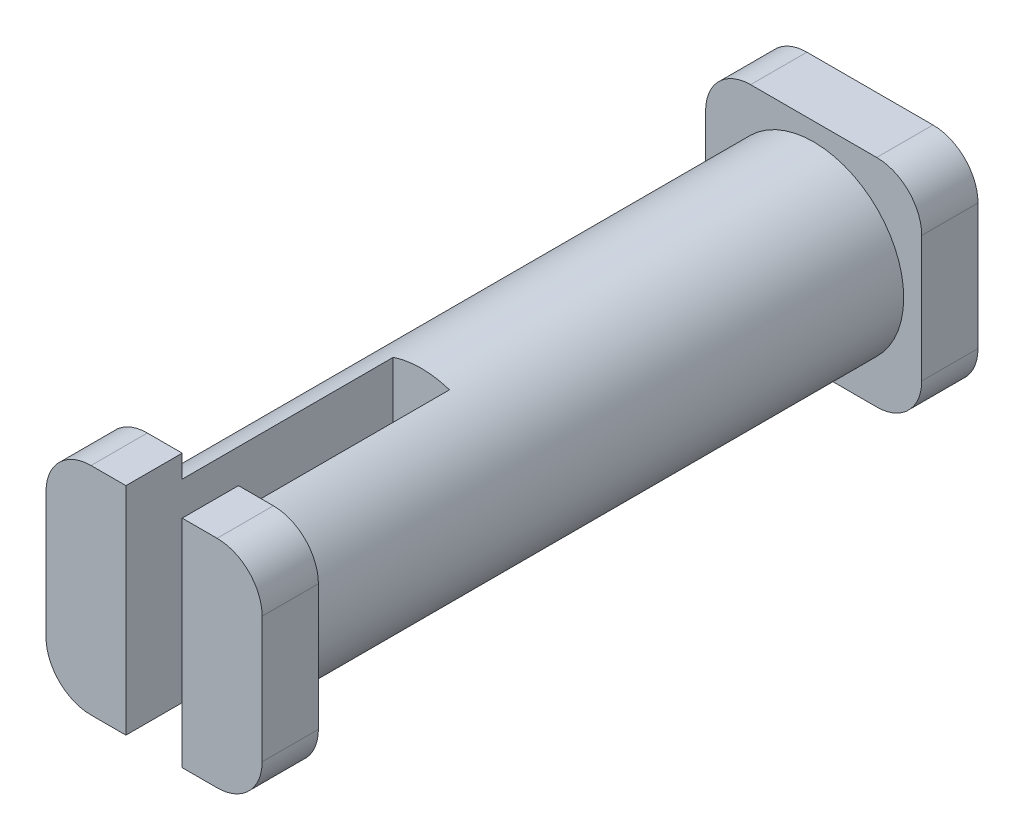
ISO-10303-21;
HEADER;
FILE_DESCRIPTION(('STEP AP214'),'2;1');
FILE_NAME('part.step','',(''),(''),'','','');
FILE_SCHEMA(('AUTOMOTIVE_DESIGN { 1 0 10303 214 1 1 1 1 }'));
ENDSEC;
DATA;
#1=APPLICATION_CONTEXT('core data for automotive mechanical design processes');
#2=APPLICATION_PROTOCOL_DEFINITION('international standard','automotive_design',2000,#1);
#3=PRODUCT_CONTEXT('',#1,'mechanical');
#4=PRODUCT('Part','Part','',(#3));
#5=PRODUCT_RELATED_PRODUCT_CATEGORY('part','',(#4));
#6=PRODUCT_DEFINITION_FORMATION('','',#4);
#7=PRODUCT_DEFINITION_CONTEXT('part definition',#1,'design');
#8=PRODUCT_DEFINITION('design','',#6,#7);
#9=PRODUCT_DEFINITION_SHAPE('','',#8);
#10=(LENGTH_UNIT() NAMED_UNIT(*) SI_UNIT(.MILLI.,.METRE.));
#11=(NAMED_UNIT(*) PLANE_ANGLE_UNIT() SI_UNIT($,.RADIAN.));
#12=(NAMED_UNIT(*) SI_UNIT($,.STERADIAN.) SOLID_ANGLE_UNIT());
#13=UNCERTAINTY_MEASURE_WITH_UNIT(LENGTH_MEASURE(1.E-05),#10,'distance_accuracy_value','');
#14=(GEOMETRIC_REPRESENTATION_CONTEXT(3) GLOBAL_UNCERTAINTY_ASSIGNED_CONTEXT((#13)) GLOBAL_UNIT_ASSIGNED_CONTEXT((#10,
#11,#12)) REPRESENTATION_CONTEXT('',''));
#15=CARTESIAN_POINT('',(0.,0.,0.));
#16=DIRECTION('',(0.,0.,1.));
#17=DIRECTION('',(1.,0.,0.));
#18=AXIS2_PLACEMENT_3D('',#15,#16,#17);
#19=CARTESIAN_POINT('',(1.27000000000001,0.,18.6055));
#20=DIRECTION('',(0.,-1.,0.));
#21=DIRECTION('',(0.,0.,-1.));
#22=AXIS2_PLACEMENT_3D('',#19,#20,#21);
#23=PLANE('',#22);
#24=DIRECTION('',(0.,0.,1.));
#25=VECTOR('',#24,1.);
#26=CARTESIAN_POINT('',(2.25425,0.,12.652375));
#27=LINE('',#26,#25);
#28=CARTESIAN_POINT('',(2.25425,0.,18.6055));
#29=VERTEX_POINT('',#28);
#30=CARTESIAN_POINT('',(2.25425,0.,20.193));
#31=VERTEX_POINT('',#30);
#32=EDGE_CURVE('E259',#29,#31,#27,.T.);
#33=ORIENTED_EDGE('',*,*,#32,.T.);
#34=DIRECTION('',(1.,0.,0.));
#35=VECTOR('',#34,1.);
#36=CARTESIAN_POINT('',(1.27000000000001,0.,20.193));
#37=LINE('',#36,#35);
#38=CARTESIAN_POINT('',(1.27000000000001,0.,20.193));
#39=VERTEX_POINT('',#38);
#40=EDGE_CURVE('E304',#39,#31,#37,.T.);
#41=ORIENTED_EDGE('',*,*,#40,.F.);
#42=DIRECTION('',(0.,0.,1.));
#43=VECTOR('',#42,1.);
#44=CARTESIAN_POINT('',(1.27000000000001,0.,18.6055));
#45=LINE('',#44,#43);
#46=CARTESIAN_POINT('',(1.27000000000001,0.,18.6055));
#47=VERTEX_POINT('',#46);
#48=EDGE_CURVE('E342',#47,#39,#45,.T.);
#49=ORIENTED_EDGE('',*,*,#48,.F.);
#50=DIRECTION('',(1.,0.,0.));
#51=VECTOR('',#50,1.);
#52=CARTESIAN_POINT('',(1.27000000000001,0.,18.6055));
#53=LINE('',#52,#51);
#54=EDGE_CURVE('E273',#47,#29,#53,.T.);
#55=ORIENTED_EDGE('',*,*,#54,.T.);
#56=EDGE_LOOP('',(#33,#41,#49,#55));
#57=FACE_BOUND('',#56,.T.);
#58=ADVANCED_FACE('F36',(#57),#23,.T.);
#59=CARTESIAN_POINT('',(1.27,6.096,18.6055));
#60=DIRECTION('',(0.,1.,0.));
#61=DIRECTION('',(0.,0.,1.));
#62=AXIS2_PLACEMENT_3D('',#59,#60,#61);
#63=PLANE('',#62);
#64=DIRECTION('',(0.,0.,1.));
#65=VECTOR('',#64,1.);
#66=CARTESIAN_POINT('',(2.25425,6.096,12.652375));
#67=LINE('',#66,#65);
#68=CARTESIAN_POINT('',(2.25425,6.096,18.6055));
#69=VERTEX_POINT('',#68);
#70=CARTESIAN_POINT('',(2.25425,6.096,20.193));
#71=VERTEX_POINT('',#70);
#72=EDGE_CURVE('E468',#69,#71,#67,.T.);
#73=ORIENTED_EDGE('',*,*,#72,.F.);
#74=DIRECTION('',(-1.,0.,0.));
#75=VECTOR('',#74,1.);
#76=CARTESIAN_POINT('',(1.27,6.096,18.6055));
#77=LINE('',#76,#75);
#78=CARTESIAN_POINT('',(1.27,6.096,18.6055));
#79=VERTEX_POINT('',#78);
#80=EDGE_CURVE('E289',#69,#79,#77,.T.);
#81=ORIENTED_EDGE('',*,*,#80,.T.);
#82=DIRECTION('',(0.,0.,1.));
#83=VECTOR('',#82,1.);
#84=CARTESIAN_POINT('',(1.27,6.096,18.6055));
#85=LINE('',#84,#83);
#86=CARTESIAN_POINT('',(1.27,6.096,20.193));
#87=VERTEX_POINT('',#86);
#88=EDGE_CURVE('E333',#79,#87,#85,.T.);
#89=ORIENTED_EDGE('',*,*,#88,.T.);
#90=DIRECTION('',(-1.,0.,0.));
#91=VECTOR('',#90,1.);
#92=CARTESIAN_POINT('',(1.27,6.096,20.193));
#93=LINE('',#92,#91);
#94=EDGE_CURVE('E316',#71,#87,#93,.T.);
#95=ORIENTED_EDGE('',*,*,#94,.F.);
#96=EDGE_LOOP('',(#73,#81,#89,#95));
#97=FACE_BOUND('',#96,.T.);
#98=ADVANCED_FACE('F219',(#97),#63,.T.);
#99=CARTESIAN_POINT('',(4.826,1.27,18.6055));
#100=DIRECTION('',(0.,0.,-1.));
#101=DIRECTION('',(1.,0.,0.));
#102=AXIS2_PLACEMENT_3D('',#99,#100,#101);
#103=PLANE('',#102);
#104=DIRECTION('',(0.,1.,0.));
#105=VECTOR('',#104,1.);
#106=CARTESIAN_POINT('',(2.25425,1.27,18.6055));
#107=LINE('',#106,#105);
#108=CARTESIAN_POINT('',(2.25425,0.635208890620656,18.6055));
#109=VERTEX_POINT('',#108);
#110=EDGE_CURVE('E356',#29,#109,#107,.T.);
#111=ORIENTED_EDGE('',*,*,#110,.F.);
#112=ORIENTED_EDGE('',*,*,#54,.F.);
#113=CARTESIAN_POINT('',(1.27,1.27,18.6055));
#114=DIRECTION('',(0.,0.,1.));
#115=DIRECTION('',(-1.,0.,0.));
#116=AXIS2_PLACEMENT_3D('',#113,#114,#115);
#117=CIRCLE('',#116,1.27);
#118=CARTESIAN_POINT('',(0.,1.27,18.6055));
#119=VERTEX_POINT('',#118);
#120=EDGE_CURVE('E276',#119,#47,#117,.T.);
#121=ORIENTED_EDGE('',*,*,#120,.F.);
#122=DIRECTION('',(0.,-1.,0.));
#123=VECTOR('',#122,1.);
#124=CARTESIAN_POINT('',(0.,1.27000000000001,18.6055));
#125=LINE('',#124,#123);
#126=CARTESIAN_POINT('',(0.,4.826,18.6055));
#127=VERTEX_POINT('',#126);
#128=EDGE_CURVE('E283',#127,#119,#125,.T.);
#129=ORIENTED_EDGE('',*,*,#128,.F.);
#130=CARTESIAN_POINT('',(1.27,4.826,18.6055));
#131=DIRECTION('',(0.,0.,1.));
#132=DIRECTION('',(-1.,0.,0.));
#133=AXIS2_PLACEMENT_3D('',#130,#131,#132);
#134=CIRCLE('',#133,1.27);
#135=EDGE_CURVE('E286',#79,#127,#134,.T.);
#136=ORIENTED_EDGE('',*,*,#135,.F.);
#137=ORIENTED_EDGE('',*,*,#80,.F.);
#138=CARTESIAN_POINT('',(2.25425,5.46079110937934,18.6055));
#139=VERTEX_POINT('',#138);
#140=EDGE_CURVE('E360',#139,#69,#107,.T.);
#141=ORIENTED_EDGE('',*,*,#140,.F.);
#142=CARTESIAN_POINT('',(3.048,3.048,18.6055));
#143=DIRECTION('',(0.,0.,1.));
#144=DIRECTION('',(1.,0.,0.));
#145=AXIS2_PLACEMENT_3D('',#142,#143,#144);
#146=CIRCLE('',#145,2.54);
#147=EDGE_CURVE('E150',#139,#109,#146,.T.);
#148=ORIENTED_EDGE('',*,*,#147,.T.);
#149=EDGE_LOOP('',(#111,#112,#121,#129,#136,#137,#141,#148));
#150=FACE_BOUND('',#149,.T.);
#151=ADVANCED_FACE('F226',(#150),#103,.T.);
#152=CARTESIAN_POINT('',(4.826,1.27,20.193));
#153=DIRECTION('',(0.,0.,-1.));
#154=DIRECTION('',(1.,0.,0.));
#155=AXIS2_PLACEMENT_3D('',#152,#153,#154);
#156=PLANE('',#155);
#157=ORIENTED_EDGE('',*,*,#40,.T.);
#158=DIRECTION('',(0.,-1.,0.));
#159=VECTOR('',#158,1.);
#160=CARTESIAN_POINT('',(2.25425,6.096,20.193));
#161=LINE('',#160,#159);
#162=EDGE_CURVE('E455',#71,#31,#161,.T.);
#163=ORIENTED_EDGE('',*,*,#162,.F.);
#164=ORIENTED_EDGE('',*,*,#94,.T.);
#165=CARTESIAN_POINT('',(1.27,4.826,20.193));
#166=DIRECTION('',(0.,0.,1.));
#167=DIRECTION('',(-1.,0.,0.));
#168=AXIS2_PLACEMENT_3D('',#165,#166,#167);
#169=CIRCLE('',#168,1.27);
#170=CARTESIAN_POINT('',(0.,4.826,20.193));
#171=VERTEX_POINT('',#170);
#172=EDGE_CURVE('E313',#87,#171,#169,.T.);
#173=ORIENTED_EDGE('',*,*,#172,.T.);
#174=DIRECTION('',(0.,-1.,0.));
#175=VECTOR('',#174,1.);
#176=CARTESIAN_POINT('',(0.,1.27000000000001,20.193));
#177=LINE('',#176,#175);
#178=CARTESIAN_POINT('',(0.,1.27,20.193));
#179=VERTEX_POINT('',#178);
#180=EDGE_CURVE('E310',#171,#179,#177,.T.);
#181=ORIENTED_EDGE('',*,*,#180,.T.);
#182=CARTESIAN_POINT('',(1.27,1.27,20.193));
#183=DIRECTION('',(0.,0.,1.));
#184=DIRECTION('',(-1.,0.,0.));
#185=AXIS2_PLACEMENT_3D('',#182,#183,#184);
#186=CIRCLE('',#185,1.27);
#187=EDGE_CURVE('E307',#179,#39,#186,.T.);
#188=ORIENTED_EDGE('',*,*,#187,.T.);
#189=EDGE_LOOP('',(#157,#163,#164,#173,#181,#188));
#190=FACE_BOUND('',#189,.T.);
#191=ADVANCED_FACE('F444',(#190),#156,.F.);
#192=CARTESIAN_POINT('',(4.826,1.27,1.5875));
#193=DIRECTION('',(0.,0.,-1.));
#194=DIRECTION('',(-1.,0.,0.));
#195=AXIS2_PLACEMENT_3D('',#192,#193,#194);
#196=CYLINDRICAL_SURFACE('',#195,1.27);
#197=CARTESIAN_POINT('',(4.826,1.27,0.));
#198=DIRECTION('',(0.,0.,1.));
#199=DIRECTION('',(1.,0.,0.));
#200=AXIS2_PLACEMENT_3D('',#197,#198,#199);
#201=CIRCLE('',#200,1.27);
#202=CARTESIAN_POINT('',(4.826,0.,0.));
#203=VERTEX_POINT('',#202);
#204=CARTESIAN_POINT('',(6.096,1.27,0.));
#205=VERTEX_POINT('',#204);
#206=EDGE_CURVE('E146',#203,#205,#201,.T.);
#207=ORIENTED_EDGE('',*,*,#206,.T.);
#208=DIRECTION('',(0.,0.,-1.));
#209=VECTOR('',#208,1.);
#210=CARTESIAN_POINT('',(6.096,1.27,1.5875));
#211=LINE('',#210,#209);
#212=CARTESIAN_POINT('',(6.096,1.27,1.5875));
#213=VERTEX_POINT('',#212);
#214=EDGE_CURVE('E174',#213,#205,#211,.T.);
#215=ORIENTED_EDGE('',*,*,#214,.F.);
#216=CARTESIAN_POINT('',(4.826,1.27,1.5875));
#217=DIRECTION('',(0.,0.,1.));
#218=DIRECTION('',(1.,0.,0.));
#219=AXIS2_PLACEMENT_3D('',#216,#217,#218);
#220=CIRCLE('',#219,1.27);
#221=CARTESIAN_POINT('',(4.826,0.,1.5875));
#222=VERTEX_POINT('',#221);
#223=EDGE_CURVE('E162',#222,#213,#220,.T.);
#224=ORIENTED_EDGE('',*,*,#223,.F.);
#225=DIRECTION('',(0.,0.,-1.));
#226=VECTOR('',#225,1.);
#227=CARTESIAN_POINT('',(4.826,0.,1.5875));
#228=LINE('',#227,#226);
#229=EDGE_CURVE('E142',#222,#203,#228,.T.);
#230=ORIENTED_EDGE('',*,*,#229,.T.);
#231=EDGE_LOOP('',(#207,#215,#224,#230));
#232=FACE_BOUND('',#231,.T.);
#233=ADVANCED_FACE('F38',(#232),#196,.T.);
#234=CARTESIAN_POINT('',(6.096,1.27,1.5875));
#235=DIRECTION('',(-1.,0.,0.));
#236=DIRECTION('',(0.,-1.,0.));
#237=AXIS2_PLACEMENT_3D('',#234,#235,#236);
#238=PLANE('',#237);
#239=DIRECTION('',(0.,1.,0.));
#240=VECTOR('',#239,1.);
#241=CARTESIAN_POINT('',(6.096,1.27,0.));
#242=LINE('',#241,#240);
#243=CARTESIAN_POINT('',(6.096,4.826,0.));
#244=VERTEX_POINT('',#243);
#245=EDGE_CURVE('E149',#205,#244,#242,.T.);
#246=ORIENTED_EDGE('',*,*,#245,.T.);
#247=DIRECTION('',(0.,0.,-1.));
#248=VECTOR('',#247,1.);
#249=CARTESIAN_POINT('',(6.096,4.826,1.5875));
#250=LINE('',#249,#248);
#251=CARTESIAN_POINT('',(6.096,4.826,1.5875));
#252=VERTEX_POINT('',#251);
#253=EDGE_CURVE('E172',#252,#244,#250,.T.);
#254=ORIENTED_EDGE('',*,*,#253,.F.);
#255=DIRECTION('',(0.,1.,0.));
#256=VECTOR('',#255,1.);
#257=CARTESIAN_POINT('',(6.096,1.27,1.5875));
#258=LINE('',#257,#256);
#259=EDGE_CURVE('E102',#213,#252,#258,.T.);
#260=ORIENTED_EDGE('',*,*,#259,.F.);
#261=ORIENTED_EDGE('',*,*,#214,.T.);
#262=EDGE_LOOP('',(#246,#254,#260,#261));
#263=FACE_BOUND('',#262,.T.);
#264=ADVANCED_FACE('F207',(#263),#238,.F.);
#265=CARTESIAN_POINT('',(4.826,4.826,1.5875));
#266=DIRECTION('',(0.,0.,-1.));
#267=DIRECTION('',(-1.,0.,0.));
#268=AXIS2_PLACEMENT_3D('',#265,#266,#267);
#269=CYLINDRICAL_SURFACE('',#268,1.27);
#270=CARTESIAN_POINT('',(4.826,4.826,0.));
#271=DIRECTION('',(0.,0.,1.));
#272=DIRECTION('',(-1.,0.,0.));
#273=AXIS2_PLACEMENT_3D('',#270,#271,#272);
#274=CIRCLE('',#273,1.27);
#275=CARTESIAN_POINT('',(4.826,6.096,0.));
#276=VERTEX_POINT('',#275);
#277=EDGE_CURVE('E152',#244,#276,#274,.T.);
#278=ORIENTED_EDGE('',*,*,#277,.T.);
#279=DIRECTION('',(0.,0.,-1.));
#280=VECTOR('',#279,1.);
#281=CARTESIAN_POINT('',(4.826,6.096,1.5875));
#282=LINE('',#281,#280);
#283=CARTESIAN_POINT('',(4.826,6.096,1.5875));
#284=VERTEX_POINT('',#283);
#285=EDGE_CURVE('E169',#284,#276,#282,.T.);
#286=ORIENTED_EDGE('',*,*,#285,.F.);
#287=CARTESIAN_POINT('',(4.826,4.826,1.5875));
#288=DIRECTION('',(0.,0.,1.));
#289=DIRECTION('',(-1.,0.,0.));
#290=AXIS2_PLACEMENT_3D('',#287,#288,#289);
#291=CIRCLE('',#290,1.27);
#292=EDGE_CURVE('E188',#252,#284,#291,.T.);
#293=ORIENTED_EDGE('',*,*,#292,.F.);
#294=ORIENTED_EDGE('',*,*,#253,.T.);
#295=EDGE_LOOP('',(#278,#286,#293,#294));
#296=FACE_BOUND('',#295,.T.);
#297=ADVANCED_FACE('F210',(#296),#269,.T.);
#298=CARTESIAN_POINT('',(1.27,6.096,1.5875));
#299=DIRECTION('',(0.,-1.,0.));
#300=DIRECTION('',(0.,0.,-1.));
#301=AXIS2_PLACEMENT_3D('',#298,#299,#300);
#302=PLANE('',#301);
#303=DIRECTION('',(-1.,0.,0.));
#304=VECTOR('',#303,1.);
#305=CARTESIAN_POINT('',(1.27,6.096,0.));
#306=LINE('',#305,#304);
#307=CARTESIAN_POINT('',(1.27,6.096,0.));
#308=VERTEX_POINT('',#307);
#309=EDGE_CURVE('E154',#276,#308,#306,.T.);
#310=ORIENTED_EDGE('',*,*,#309,.T.);
#311=DIRECTION('',(0.,0.,-1.));
#312=VECTOR('',#311,1.);
#313=CARTESIAN_POINT('',(1.27,6.096,1.5875));
#314=LINE('',#313,#312);
#315=CARTESIAN_POINT('',(1.27,6.096,1.5875));
#316=VERTEX_POINT('',#315);
#317=EDGE_CURVE('E166',#316,#308,#314,.T.);
#318=ORIENTED_EDGE('',*,*,#317,.F.);
#319=DIRECTION('',(-1.,0.,0.));
#320=VECTOR('',#319,1.);
#321=CARTESIAN_POINT('',(1.27,6.096,1.5875));
#322=LINE('',#321,#320);
#323=EDGE_CURVE('E190',#284,#316,#322,.T.);
#324=ORIENTED_EDGE('',*,*,#323,.F.);
#325=ORIENTED_EDGE('',*,*,#285,.T.);
#326=EDGE_LOOP('',(#310,#318,#324,#325));
#327=FACE_BOUND('',#326,.T.);
#328=ADVANCED_FACE('F196',(#327),#302,.F.);
#329=CARTESIAN_POINT('',(1.27,4.826,1.5875));
#330=DIRECTION('',(0.,0.,-1.));
#331=DIRECTION('',(-1.,0.,0.));
#332=AXIS2_PLACEMENT_3D('',#329,#330,#331);
#333=CYLINDRICAL_SURFACE('',#332,1.27);
#334=CARTESIAN_POINT('',(1.27,4.826,0.));
#335=DIRECTION('',(0.,0.,1.));
#336=DIRECTION('',(-1.,0.,0.));
#337=AXIS2_PLACEMENT_3D('',#334,#335,#336);
#338=CIRCLE('',#337,1.27);
#339=CARTESIAN_POINT('',(0.,4.826,0.));
#340=VERTEX_POINT('',#339);
#341=EDGE_CURVE('E156',#308,#340,#338,.T.);
#342=ORIENTED_EDGE('',*,*,#341,.T.);
#343=DIRECTION('',(0.,0.,-1.));
#344=VECTOR('',#343,1.);
#345=CARTESIAN_POINT('',(0.,4.826,1.5875));
#346=LINE('',#345,#344);
#347=CARTESIAN_POINT('',(0.,4.826,1.5875));
#348=VERTEX_POINT('',#347);
#349=EDGE_CURVE('E137',#348,#340,#346,.T.);
#350=ORIENTED_EDGE('',*,*,#349,.F.);
#351=CARTESIAN_POINT('',(1.27,4.826,1.5875));
#352=DIRECTION('',(0.,0.,1.));
#353=DIRECTION('',(-1.,0.,0.));
#354=AXIS2_PLACEMENT_3D('',#351,#352,#353);
#355=CIRCLE('',#354,1.27);
#356=EDGE_CURVE('E125',#316,#348,#355,.T.);
#357=ORIENTED_EDGE('',*,*,#356,.F.);
#358=ORIENTED_EDGE('',*,*,#317,.T.);
#359=EDGE_LOOP('',(#342,#350,#357,#358));
#360=FACE_BOUND('',#359,.T.);
#361=ADVANCED_FACE('F200',(#360),#333,.T.);
#362=CARTESIAN_POINT('',(0.,1.27000000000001,1.5875));
#363=DIRECTION('',(1.,0.,0.));
#364=DIRECTION('',(0.,1.,0.));
#365=AXIS2_PLACEMENT_3D('',#362,#363,#364);
#366=PLANE('',#365);
#367=DIRECTION('',(0.,-1.,0.));
#368=VECTOR('',#367,1.);
#369=CARTESIAN_POINT('',(0.,1.27000000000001,0.));
#370=LINE('',#369,#368);
#371=CARTESIAN_POINT('',(0.,1.27,0.));
#372=VERTEX_POINT('',#371);
#373=EDGE_CURVE('E134',#340,#372,#370,.T.);
#374=ORIENTED_EDGE('',*,*,#373,.T.);
#375=DIRECTION('',(0.,0.,-1.));
#376=VECTOR('',#375,1.);
#377=CARTESIAN_POINT('',(0.,1.27,1.5875));
#378=LINE('',#377,#376);
#379=CARTESIAN_POINT('',(0.,1.27,1.5875));
#380=VERTEX_POINT('',#379);
#381=EDGE_CURVE('E131',#380,#372,#378,.T.);
#382=ORIENTED_EDGE('',*,*,#381,.F.);
#383=DIRECTION('',(0.,-1.,0.));
#384=VECTOR('',#383,1.);
#385=CARTESIAN_POINT('',(0.,1.27000000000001,1.5875));
#386=LINE('',#385,#384);
#387=EDGE_CURVE('E118',#348,#380,#386,.T.);
#388=ORIENTED_EDGE('',*,*,#387,.F.);
#389=ORIENTED_EDGE('',*,*,#349,.T.);
#390=EDGE_LOOP('',(#374,#382,#388,#389));
#391=FACE_BOUND('',#390,.T.);
#392=ADVANCED_FACE('F132',(#391),#366,.F.);
#393=CARTESIAN_POINT('',(1.27,1.27,1.5875));
#394=DIRECTION('',(0.,0.,-1.));
#395=DIRECTION('',(-1.,0.,0.));
#396=AXIS2_PLACEMENT_3D('',#393,#394,#395);
#397=CYLINDRICAL_SURFACE('',#396,1.27);
#398=CARTESIAN_POINT('',(1.27,1.27,0.));
#399=DIRECTION('',(0.,0.,1.));
#400=DIRECTION('',(-1.,0.,0.));
#401=AXIS2_PLACEMENT_3D('',#398,#399,#400);
#402=CIRCLE('',#401,1.27);
#403=CARTESIAN_POINT('',(1.27000000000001,0.,0.));
#404=VERTEX_POINT('',#403);
#405=EDGE_CURVE('E159',#372,#404,#402,.T.);
#406=ORIENTED_EDGE('',*,*,#405,.T.);
#407=DIRECTION('',(0.,0.,-1.));
#408=VECTOR('',#407,1.);
#409=CARTESIAN_POINT('',(1.27000000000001,0.,1.5875));
#410=LINE('',#409,#408);
#411=CARTESIAN_POINT('',(1.27000000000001,0.,1.5875));
#412=VERTEX_POINT('',#411);
#413=EDGE_CURVE('E138',#412,#404,#410,.T.);
#414=ORIENTED_EDGE('',*,*,#413,.F.);
#415=CARTESIAN_POINT('',(1.27,1.27,1.5875));
#416=DIRECTION('',(0.,0.,1.));
#417=DIRECTION('',(-1.,0.,0.));
#418=AXIS2_PLACEMENT_3D('',#415,#416,#417);
#419=CIRCLE('',#418,1.27);
#420=EDGE_CURVE('E122',#380,#412,#419,.T.);
#421=ORIENTED_EDGE('',*,*,#420,.F.);
#422=ORIENTED_EDGE('',*,*,#381,.T.);
#423=EDGE_LOOP('',(#406,#414,#421,#422));
#424=FACE_BOUND('',#423,.T.);
#425=ADVANCED_FACE('F140',(#424),#397,.T.);
#426=CARTESIAN_POINT('',(1.27000000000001,0.,1.5875));
#427=DIRECTION('',(0.,1.,0.));
#428=DIRECTION('',(0.,0.,1.));
#429=AXIS2_PLACEMENT_3D('',#426,#427,#428);
#430=PLANE('',#429);
#431=DIRECTION('',(1.,0.,0.));
#432=VECTOR('',#431,1.);
#433=CARTESIAN_POINT('',(1.27000000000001,0.,0.));
#434=LINE('',#433,#432);
#435=EDGE_CURVE('E93',#404,#203,#434,.T.);
#436=ORIENTED_EDGE('',*,*,#435,.T.);
#437=ORIENTED_EDGE('',*,*,#229,.F.);
#438=DIRECTION('',(1.,0.,0.));
#439=VECTOR('',#438,1.);
#440=CARTESIAN_POINT('',(1.27000000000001,0.,1.5875));
#441=LINE('',#440,#439);
#442=EDGE_CURVE('E60',#412,#222,#441,.T.);
#443=ORIENTED_EDGE('',*,*,#442,.F.);
#444=ORIENTED_EDGE('',*,*,#413,.T.);
#445=EDGE_LOOP('',(#436,#437,#443,#444));
#446=FACE_BOUND('',#445,.T.);
#447=ADVANCED_FACE('F204',(#446),#430,.F.);
#448=CARTESIAN_POINT('',(4.826,1.27,1.5875));
#449=DIRECTION('',(0.,0.,1.));
#450=DIRECTION('',(1.,0.,0.));
#451=AXIS2_PLACEMENT_3D('',#448,#449,#450);
#452=PLANE('',#451);
#453=CARTESIAN_POINT('',(3.048,3.048,1.5875));
#454=DIRECTION('',(0.,0.,1.));
#455=DIRECTION('',(1.,0.,0.));
#456=AXIS2_PLACEMENT_3D('',#453,#454,#455);
#457=CIRCLE('',#456,2.54);
#458=CARTESIAN_POINT('',(5.588,3.048,1.5875));
#459=VERTEX_POINT('',#458);
#460=EDGE_CURVE('E175',#459,#459,#457,.T.);
#461=ORIENTED_EDGE('',*,*,#460,.F.);
#462=EDGE_LOOP('',(#461));
#463=FACE_BOUND('',#462,.T.);
#464=ORIENTED_EDGE('',*,*,#223,.T.);
#465=ORIENTED_EDGE('',*,*,#259,.T.);
#466=ORIENTED_EDGE('',*,*,#292,.T.);
#467=ORIENTED_EDGE('',*,*,#323,.T.);
#468=ORIENTED_EDGE('',*,*,#356,.T.);
#469=ORIENTED_EDGE('',*,*,#387,.T.);
#470=ORIENTED_EDGE('',*,*,#420,.T.);
#471=ORIENTED_EDGE('',*,*,#442,.T.);
#472=EDGE_LOOP('',(#464,#465,#466,#467,#468,#469,#470,#471));
#473=FACE_BOUND('',#472,.T.);
#474=ADVANCED_FACE('F120',(#463,#473),#452,.T.);
#475=CARTESIAN_POINT('',(4.826,1.27,0.));
#476=DIRECTION('',(0.,0.,1.));
#477=DIRECTION('',(1.,0.,0.));
#478=AXIS2_PLACEMENT_3D('',#475,#476,#477);
#479=PLANE('',#478);
#480=ORIENTED_EDGE('',*,*,#206,.F.);
#481=ORIENTED_EDGE('',*,*,#435,.F.);
#482=ORIENTED_EDGE('',*,*,#405,.F.);
#483=ORIENTED_EDGE('',*,*,#373,.F.);
#484=ORIENTED_EDGE('',*,*,#341,.F.);
#485=ORIENTED_EDGE('',*,*,#309,.F.);
#486=ORIENTED_EDGE('',*,*,#277,.F.);
#487=ORIENTED_EDGE('',*,*,#245,.F.);
#488=EDGE_LOOP('',(#480,#481,#482,#483,#484,#485,#486,#487));
#489=FACE_BOUND('',#488,.T.);
#490=ADVANCED_FACE('F203',(#489),#479,.F.);
#491=CARTESIAN_POINT('',(3.048,3.048,18.6055));
#492=DIRECTION('',(0.,0.,-1.));
#493=DIRECTION('',(-1.,0.,0.));
#494=AXIS2_PLACEMENT_3D('',#491,#492,#493);
#495=CYLINDRICAL_SURFACE('',#494,2.54);
#496=ORIENTED_EDGE('',*,*,#147,.F.);
#497=DIRECTION('',(0.,0.,-1.));
#498=VECTOR('',#497,1.);
#499=CARTESIAN_POINT('',(2.25425,5.46079110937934,18.6055));
#500=LINE('',#499,#498);
#501=CARTESIAN_POINT('',(2.25425,5.46079110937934,12.652375));
#502=VERTEX_POINT('',#501);
#503=EDGE_CURVE('E368',#139,#502,#500,.T.);
#504=ORIENTED_EDGE('',*,*,#503,.T.);
#505=CARTESIAN_POINT('',(3.048,3.048,12.652375));
#506=DIRECTION('',(0.,0.,1.));
#507=DIRECTION('',(1.,0.,0.));
#508=AXIS2_PLACEMENT_3D('',#505,#506,#507);
#509=CIRCLE('',#508,2.54);
#510=CARTESIAN_POINT('',(3.84175,5.46079110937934,12.652375));
#511=VERTEX_POINT('',#510);
#512=EDGE_CURVE('E11',#511,#502,#509,.T.);
#513=ORIENTED_EDGE('',*,*,#512,.F.);
#514=DIRECTION('',(0.,0.,-1.));
#515=VECTOR('',#514,1.);
#516=CARTESIAN_POINT('',(3.84175,5.46079110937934,18.6055));
#517=LINE('',#516,#515);
#518=CARTESIAN_POINT('',(3.84175,5.46079110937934,18.6055));
#519=VERTEX_POINT('',#518);
#520=EDGE_CURVE('E472',#511,#519,#517,.F.);
#521=ORIENTED_EDGE('',*,*,#520,.T.);
#522=CARTESIAN_POINT('',(3.84175,0.635208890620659,18.6055));
#523=VERTEX_POINT('',#522);
#524=EDGE_CURVE('E184',#523,#519,#146,.T.);
#525=ORIENTED_EDGE('',*,*,#524,.F.);
#526=DIRECTION('',(0.,0.,-1.));
#527=VECTOR('',#526,1.);
#528=CARTESIAN_POINT('',(3.84175,0.635208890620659,18.6055));
#529=LINE('',#528,#527);
#530=CARTESIAN_POINT('',(3.84175,0.635208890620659,12.652375));
#531=VERTEX_POINT('',#530);
#532=EDGE_CURVE('E467',#523,#531,#529,.T.);
#533=ORIENTED_EDGE('',*,*,#532,.T.);
#534=CARTESIAN_POINT('',(2.25425,0.635208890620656,12.652375));
#535=VERTEX_POINT('',#534);
#536=EDGE_CURVE('E40',#535,#531,#509,.T.);
#537=ORIENTED_EDGE('',*,*,#536,.F.);
#538=DIRECTION('',(0.,0.,-1.));
#539=VECTOR('',#538,1.);
#540=CARTESIAN_POINT('',(2.25425,0.635208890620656,18.6055));
#541=LINE('',#540,#539);
#542=EDGE_CURVE('E303',#535,#109,#541,.F.);
#543=ORIENTED_EDGE('',*,*,#542,.T.);
#544=EDGE_LOOP('',(#496,#504,#513,#521,#525,#533,#537,#543));
#545=FACE_BOUND('',#544,.T.);
#546=ORIENTED_EDGE('',*,*,#460,.T.);
#547=EDGE_LOOP('',(#546));
#548=FACE_BOUND('',#547,.T.);
#549=ADVANCED_FACE('F243',(#545,#548),#495,.T.);
#550=CARTESIAN_POINT('',(4.826,1.27,18.6055));
#551=DIRECTION('',(0.,0.,1.));
#552=DIRECTION('',(1.,0.,0.));
#553=AXIS2_PLACEMENT_3D('',#550,#551,#552);
#554=CYLINDRICAL_SURFACE('',#553,1.27);
#555=CARTESIAN_POINT('',(4.826,1.27,20.193));
#556=DIRECTION('',(0.,0.,1.));
#557=DIRECTION('',(1.,0.,0.));
#558=AXIS2_PLACEMENT_3D('',#555,#556,#557);
#559=CIRCLE('',#558,1.27);
#560=CARTESIAN_POINT('',(4.826,0.,20.193));
#561=VERTEX_POINT('',#560);
#562=CARTESIAN_POINT('',(6.096,1.27,20.193));
#563=VERTEX_POINT('',#562);
#564=EDGE_CURVE('E300',#561,#563,#559,.T.);
#565=ORIENTED_EDGE('',*,*,#564,.F.);
#566=DIRECTION('',(0.,0.,1.));
#567=VECTOR('',#566,1.);
#568=CARTESIAN_POINT('',(4.826,0.,18.6055));
#569=LINE('',#568,#567);
#570=CARTESIAN_POINT('',(4.826,0.,18.6055));
#571=VERTEX_POINT('',#570);
#572=EDGE_CURVE('E344',#571,#561,#569,.T.);
#573=ORIENTED_EDGE('',*,*,#572,.F.);
#574=CARTESIAN_POINT('',(4.826,1.27,18.6055));
#575=DIRECTION('',(0.,0.,1.));
#576=DIRECTION('',(1.,0.,0.));
#577=AXIS2_PLACEMENT_3D('',#574,#575,#576);
#578=CIRCLE('',#577,1.27);
#579=CARTESIAN_POINT('',(6.096,1.27,18.6055));
#580=VERTEX_POINT('',#579);
#581=EDGE_CURVE('E272',#571,#580,#578,.T.);
#582=ORIENTED_EDGE('',*,*,#581,.T.);
#583=DIRECTION('',(0.,0.,1.));
#584=VECTOR('',#583,1.);
#585=CARTESIAN_POINT('',(6.096,1.27,18.6055));
#586=LINE('',#585,#584);
#587=EDGE_CURVE('E299',#580,#563,#586,.T.);
#588=ORIENTED_EDGE('',*,*,#587,.T.);
#589=EDGE_LOOP('',(#565,#573,#582,#588));
#590=FACE_BOUND('',#589,.T.);
#591=ADVANCED_FACE('F235',(#590),#554,.T.);
#592=DIRECTION('',(0.,0.,1.));
#593=VECTOR('',#592,1.);
#594=CARTESIAN_POINT('',(3.84175,0.,12.652375));
#595=LINE('',#594,#593);
#596=CARTESIAN_POINT('',(3.84175,0.,18.6055));
#597=VERTEX_POINT('',#596);
#598=CARTESIAN_POINT('',(3.84175,0.,20.193));
#599=VERTEX_POINT('',#598);
#600=EDGE_CURVE('E51',#597,#599,#595,.T.);
#601=ORIENTED_EDGE('',*,*,#600,.F.);
#602=EDGE_CURVE('E251',#597,#571,#53,.T.);
#603=ORIENTED_EDGE('',*,*,#602,.T.);
#604=ORIENTED_EDGE('',*,*,#572,.T.);
#605=EDGE_CURVE('E254',#599,#561,#37,.T.);
#606=ORIENTED_EDGE('',*,*,#605,.F.);
#607=EDGE_LOOP('',(#601,#603,#604,#606));
#608=FACE_BOUND('',#607,.T.);
#609=ADVANCED_FACE('F222',(#608),#23,.T.);
#610=CARTESIAN_POINT('',(1.27,1.27,18.6055));
#611=DIRECTION('',(0.,0.,1.));
#612=DIRECTION('',(1.,0.,0.));
#613=AXIS2_PLACEMENT_3D('',#610,#611,#612);
#614=CYLINDRICAL_SURFACE('',#613,1.27);
#615=ORIENTED_EDGE('',*,*,#187,.F.);
#616=DIRECTION('',(0.,0.,1.));
#617=VECTOR('',#616,1.);
#618=CARTESIAN_POINT('',(0.,1.27,18.6055));
#619=LINE('',#618,#617);
#620=EDGE_CURVE('E339',#119,#179,#619,.T.);
#621=ORIENTED_EDGE('',*,*,#620,.F.);
#622=ORIENTED_EDGE('',*,*,#120,.T.);
#623=ORIENTED_EDGE('',*,*,#48,.T.);
#624=EDGE_LOOP('',(#615,#621,#622,#623));
#625=FACE_BOUND('',#624,.T.);
#626=ADVANCED_FACE('F234',(#625),#614,.T.);
#627=CARTESIAN_POINT('',(0.,1.27000000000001,18.6055));
#628=DIRECTION('',(-1.,0.,0.));
#629=DIRECTION('',(0.,-1.,0.));
#630=AXIS2_PLACEMENT_3D('',#627,#628,#629);
#631=PLANE('',#630);
#632=ORIENTED_EDGE('',*,*,#180,.F.);
#633=DIRECTION('',(0.,0.,1.));
#634=VECTOR('',#633,1.);
#635=CARTESIAN_POINT('',(0.,4.826,18.6055));
#636=LINE('',#635,#634);
#637=EDGE_CURVE('E336',#127,#171,#636,.T.);
#638=ORIENTED_EDGE('',*,*,#637,.F.);
#639=ORIENTED_EDGE('',*,*,#128,.T.);
#640=ORIENTED_EDGE('',*,*,#620,.T.);
#641=EDGE_LOOP('',(#632,#638,#639,#640));
#642=FACE_BOUND('',#641,.T.);
#643=ADVANCED_FACE('F241',(#642),#631,.T.);
#644=CARTESIAN_POINT('',(1.27,4.826,18.6055));
#645=DIRECTION('',(0.,0.,1.));
#646=DIRECTION('',(1.,0.,0.));
#647=AXIS2_PLACEMENT_3D('',#644,#645,#646);
#648=CYLINDRICAL_SURFACE('',#647,1.27);
#649=ORIENTED_EDGE('',*,*,#172,.F.);
#650=ORIENTED_EDGE('',*,*,#88,.F.);
#651=ORIENTED_EDGE('',*,*,#135,.T.);
#652=ORIENTED_EDGE('',*,*,#637,.T.);
#653=EDGE_LOOP('',(#649,#650,#651,#652));
#654=FACE_BOUND('',#653,.T.);
#655=ADVANCED_FACE('F430',(#654),#648,.T.);
#656=DIRECTION('',(0.,0.,1.));
#657=VECTOR('',#656,1.);
#658=CARTESIAN_POINT('',(3.84175,6.096,12.652375));
#659=LINE('',#658,#657);
#660=CARTESIAN_POINT('',(3.84175,6.096,18.6055));
#661=VERTEX_POINT('',#660);
#662=CARTESIAN_POINT('',(3.84175,6.096,20.193));
#663=VERTEX_POINT('',#662);
#664=EDGE_CURVE('E258',#661,#663,#659,.T.);
#665=ORIENTED_EDGE('',*,*,#664,.T.);
#666=CARTESIAN_POINT('',(4.826,6.096,20.193));
#667=VERTEX_POINT('',#666);
#668=EDGE_CURVE('E317',#667,#663,#93,.T.);
#669=ORIENTED_EDGE('',*,*,#668,.F.);
#670=DIRECTION('',(0.,0.,1.));
#671=VECTOR('',#670,1.);
#672=CARTESIAN_POINT('',(4.826,6.096,18.6055));
#673=LINE('',#672,#671);
#674=CARTESIAN_POINT('',(4.826,6.096,18.6055));
#675=VERTEX_POINT('',#674);
#676=EDGE_CURVE('E330',#675,#667,#673,.T.);
#677=ORIENTED_EDGE('',*,*,#676,.F.);
#678=EDGE_CURVE('E290',#675,#661,#77,.T.);
#679=ORIENTED_EDGE('',*,*,#678,.T.);
#680=EDGE_LOOP('',(#665,#669,#677,#679));
#681=FACE_BOUND('',#680,.T.);
#682=ADVANCED_FACE('F229',(#681),#63,.T.);
#683=CARTESIAN_POINT('',(4.826,4.826,18.6055));
#684=DIRECTION('',(0.,0.,1.));
#685=DIRECTION('',(1.,0.,0.));
#686=AXIS2_PLACEMENT_3D('',#683,#684,#685);
#687=CYLINDRICAL_SURFACE('',#686,1.27);
#688=CARTESIAN_POINT('',(4.826,4.826,20.193));
#689=DIRECTION('',(0.,0.,1.));
#690=DIRECTION('',(-1.,0.,0.));
#691=AXIS2_PLACEMENT_3D('',#688,#689,#690);
#692=CIRCLE('',#691,1.27);
#693=CARTESIAN_POINT('',(6.096,4.826,20.193));
#694=VERTEX_POINT('',#693);
#695=EDGE_CURVE('E320',#694,#667,#692,.T.);
#696=ORIENTED_EDGE('',*,*,#695,.F.);
#697=DIRECTION('',(0.,0.,1.));
#698=VECTOR('',#697,1.);
#699=CARTESIAN_POINT('',(6.096,4.826,18.6055));
#700=LINE('',#699,#698);
#701=CARTESIAN_POINT('',(6.096,4.826,18.6055));
#702=VERTEX_POINT('',#701);
#703=EDGE_CURVE('E327',#702,#694,#700,.T.);
#704=ORIENTED_EDGE('',*,*,#703,.F.);
#705=CARTESIAN_POINT('',(4.826,4.826,18.6055));
#706=DIRECTION('',(0.,0.,1.));
#707=DIRECTION('',(-1.,0.,0.));
#708=AXIS2_PLACEMENT_3D('',#705,#706,#707);
#709=CIRCLE('',#708,1.27);
#710=EDGE_CURVE('E293',#702,#675,#709,.T.);
#711=ORIENTED_EDGE('',*,*,#710,.T.);
#712=ORIENTED_EDGE('',*,*,#676,.T.);
#713=EDGE_LOOP('',(#696,#704,#711,#712));
#714=FACE_BOUND('',#713,.T.);
#715=ADVANCED_FACE('F418',(#714),#687,.T.);
#716=CARTESIAN_POINT('',(6.096,1.27,18.6055));
#717=DIRECTION('',(1.,0.,0.));
#718=DIRECTION('',(0.,1.,0.));
#719=AXIS2_PLACEMENT_3D('',#716,#717,#718);
#720=PLANE('',#719);
#721=DIRECTION('',(0.,1.,0.));
#722=VECTOR('',#721,1.);
#723=CARTESIAN_POINT('',(6.096,1.27,20.193));
#724=LINE('',#723,#722);
#725=EDGE_CURVE('E277',#563,#694,#724,.T.);
#726=ORIENTED_EDGE('',*,*,#725,.F.);
#727=ORIENTED_EDGE('',*,*,#587,.F.);
#728=DIRECTION('',(0.,1.,0.));
#729=VECTOR('',#728,1.);
#730=CARTESIAN_POINT('',(6.096,1.27,18.6055));
#731=LINE('',#730,#729);
#732=EDGE_CURVE('E296',#580,#702,#731,.T.);
#733=ORIENTED_EDGE('',*,*,#732,.T.);
#734=ORIENTED_EDGE('',*,*,#703,.T.);
#735=EDGE_LOOP('',(#726,#727,#733,#734));
#736=FACE_BOUND('',#735,.T.);
#737=ADVANCED_FACE('F416',(#736),#720,.T.);
#738=DIRECTION('',(0.,-1.,0.));
#739=VECTOR('',#738,1.);
#740=CARTESIAN_POINT('',(3.84175,1.27,18.6055));
#741=LINE('',#740,#739);
#742=EDGE_CURVE('E469',#661,#519,#741,.T.);
#743=ORIENTED_EDGE('',*,*,#742,.F.);
#744=ORIENTED_EDGE('',*,*,#678,.F.);
#745=ORIENTED_EDGE('',*,*,#710,.F.);
#746=ORIENTED_EDGE('',*,*,#732,.F.);
#747=ORIENTED_EDGE('',*,*,#581,.F.);
#748=ORIENTED_EDGE('',*,*,#602,.F.);
#749=EDGE_CURVE('E268',#523,#597,#741,.T.);
#750=ORIENTED_EDGE('',*,*,#749,.F.);
#751=ORIENTED_EDGE('',*,*,#524,.T.);
#752=EDGE_LOOP('',(#743,#744,#745,#746,#747,#748,#750,#751));
#753=FACE_BOUND('',#752,.T.);
#754=ADVANCED_FACE('F265',(#753),#103,.T.);
#755=ORIENTED_EDGE('',*,*,#668,.T.);
#756=DIRECTION('',(0.,1.,0.));
#757=VECTOR('',#756,1.);
#758=CARTESIAN_POINT('',(3.84175,6.096,20.193));
#759=LINE('',#758,#757);
#760=EDGE_CURVE('E481',#599,#663,#759,.T.);
#761=ORIENTED_EDGE('',*,*,#760,.F.);
#762=ORIENTED_EDGE('',*,*,#605,.T.);
#763=ORIENTED_EDGE('',*,*,#564,.T.);
#764=ORIENTED_EDGE('',*,*,#725,.T.);
#765=ORIENTED_EDGE('',*,*,#695,.T.);
#766=EDGE_LOOP('',(#755,#761,#762,#763,#764,#765));
#767=FACE_BOUND('',#766,.T.);
#768=ADVANCED_FACE('F415',(#767),#156,.F.);
#769=CARTESIAN_POINT('',(0.,0.,12.652375));
#770=DIRECTION('',(0.,0.,1.));
#771=DIRECTION('',(1.,0.,0.));
#772=AXIS2_PLACEMENT_3D('',#769,#770,#771);
#773=PLANE('',#772);
#774=ORIENTED_EDGE('',*,*,#512,.T.);
#775=DIRECTION('',(0.,-1.,0.));
#776=VECTOR('',#775,1.);
#777=CARTESIAN_POINT('',(2.25425,6.096,12.652375));
#778=LINE('',#777,#776);
#779=EDGE_CURVE('E462',#502,#535,#778,.T.);
#780=ORIENTED_EDGE('',*,*,#779,.T.);
#781=ORIENTED_EDGE('',*,*,#536,.T.);
#782=DIRECTION('',(0.,1.,0.));
#783=VECTOR('',#782,1.);
#784=CARTESIAN_POINT('',(3.84175,6.096,12.652375));
#785=LINE('',#784,#783);
#786=EDGE_CURVE('E459',#531,#511,#785,.T.);
#787=ORIENTED_EDGE('',*,*,#786,.T.);
#788=EDGE_LOOP('',(#774,#780,#781,#787));
#789=FACE_BOUND('',#788,.T.);
#790=ADVANCED_FACE('F479',(#789),#773,.T.);
#791=CARTESIAN_POINT('',(2.25425,6.096,12.652375));
#792=DIRECTION('',(-1.,0.,0.));
#793=DIRECTION('',(0.,-1.,0.));
#794=AXIS2_PLACEMENT_3D('',#791,#792,#793);
#795=PLANE('',#794);
#796=ORIENTED_EDGE('',*,*,#779,.F.);
#797=ORIENTED_EDGE('',*,*,#503,.F.);
#798=ORIENTED_EDGE('',*,*,#140,.T.);
#799=ORIENTED_EDGE('',*,*,#72,.T.);
#800=ORIENTED_EDGE('',*,*,#162,.T.);
#801=ORIENTED_EDGE('',*,*,#32,.F.);
#802=ORIENTED_EDGE('',*,*,#110,.T.);
#803=ORIENTED_EDGE('',*,*,#542,.F.);
#804=EDGE_LOOP('',(#796,#797,#798,#799,#800,#801,#802,#803));
#805=FACE_BOUND('',#804,.T.);
#806=ADVANCED_FACE('F476',(#805),#795,.F.);
#807=CARTESIAN_POINT('',(3.84175,6.096,12.652375));
#808=DIRECTION('',(1.,0.,0.));
#809=DIRECTION('',(0.,1.,0.));
#810=AXIS2_PLACEMENT_3D('',#807,#808,#809);
#811=PLANE('',#810);
#812=ORIENTED_EDGE('',*,*,#786,.F.);
#813=ORIENTED_EDGE('',*,*,#532,.F.);
#814=ORIENTED_EDGE('',*,*,#749,.T.);
#815=ORIENTED_EDGE('',*,*,#600,.T.);
#816=ORIENTED_EDGE('',*,*,#760,.T.);
#817=ORIENTED_EDGE('',*,*,#664,.F.);
#818=ORIENTED_EDGE('',*,*,#742,.T.);
#819=ORIENTED_EDGE('',*,*,#520,.F.);
#820=EDGE_LOOP('',(#812,#813,#814,#815,#816,#817,#818,#819));
#821=FACE_BOUND('',#820,.T.);
#822=ADVANCED_FACE('F486',(#821),#811,.F.);
#823=CLOSED_SHELL('',(#58,#98,#151,#191,#233,#264,#297,#328,#361,#392,#425,#447,#474,#490,#549,
#591,#609,#626,#643,#655,#682,#715,#737,#754,#768,#790,#806,#822));
#824=MANIFOLD_SOLID_BREP('B2',#823);
#825=ADVANCED_BREP_SHAPE_REPRESENTATION('',(#18,#824),#14);
#826=SHAPE_DEFINITION_REPRESENTATION(#9,#825);
ENDSEC;
END-ISO-10303-21;
